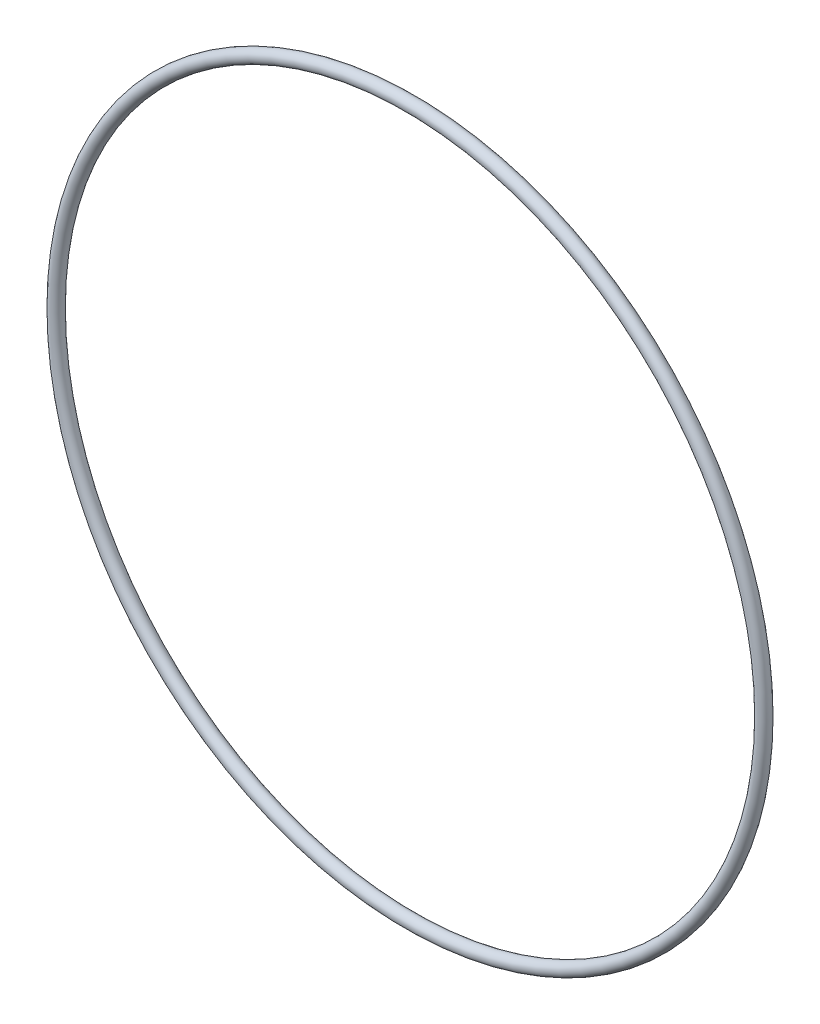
from build123d import *

# Parameters (mm, degrees)
ESQUISSE2_R = 6


with BuildPart() as part:
    # Balayage1: sweep along a path in Esquisse1
    with BuildLine(Plane.XY) as balayage1_path:
        CenterArc((0, 0), 326, 0, 360)
    # Esquisse2 → Balayage1 (sweep)
    with BuildSketch(Plane(origin=(0, 0, 0), x_dir=(1, 0, 0), z_dir=(0, 1, 0))):
        with Locations((-326, 0)):
            Circle(ESQUISSE2_R)
    sweep(path=balayage1_path.line)


solid = part.part
